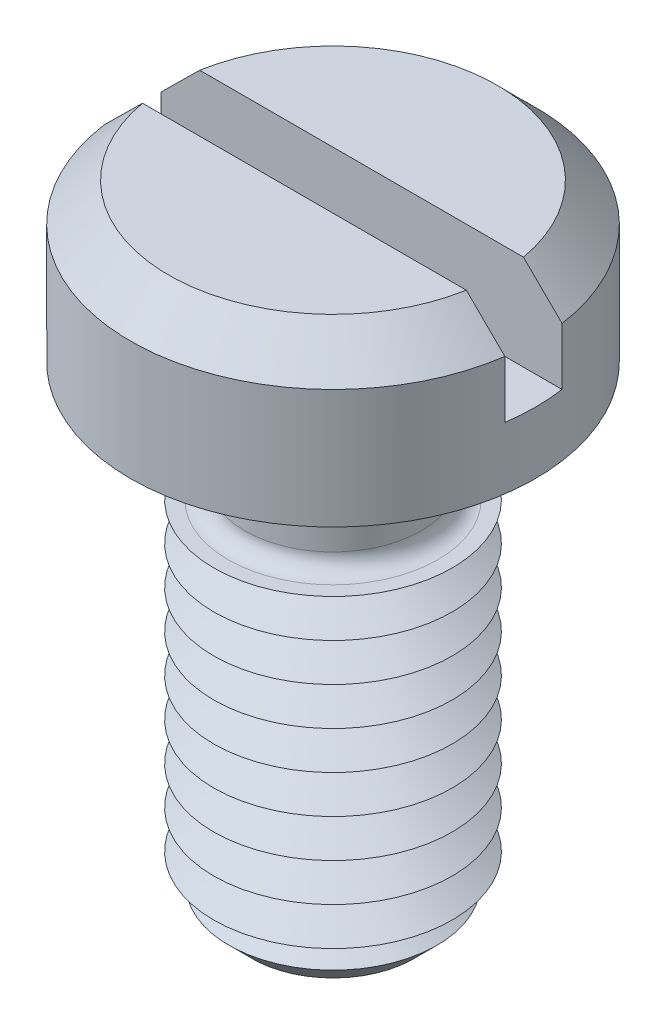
ISO-10303-21;
HEADER;
FILE_DESCRIPTION(('STEP AP214'),'2;1');
FILE_NAME('part.step','',(''),(''),'','','');
FILE_SCHEMA(('AUTOMOTIVE_DESIGN { 1 0 10303 214 1 1 1 1 }'));
ENDSEC;
DATA;
#1=APPLICATION_CONTEXT('core data for automotive mechanical design processes');
#2=APPLICATION_PROTOCOL_DEFINITION('international standard','automotive_design',2000,#1);
#3=PRODUCT_CONTEXT('',#1,'mechanical');
#4=PRODUCT('Part','Part','',(#3));
#5=PRODUCT_RELATED_PRODUCT_CATEGORY('part','',(#4));
#6=PRODUCT_DEFINITION_FORMATION('','',#4);
#7=PRODUCT_DEFINITION_CONTEXT('part definition',#1,'design');
#8=PRODUCT_DEFINITION('design','',#6,#7);
#9=PRODUCT_DEFINITION_SHAPE('','',#8);
#10=(LENGTH_UNIT() NAMED_UNIT(*) SI_UNIT(.MILLI.,.METRE.));
#11=(NAMED_UNIT(*) PLANE_ANGLE_UNIT() SI_UNIT($,.RADIAN.));
#12=(NAMED_UNIT(*) SI_UNIT($,.STERADIAN.) SOLID_ANGLE_UNIT());
#13=UNCERTAINTY_MEASURE_WITH_UNIT(LENGTH_MEASURE(1.E-05),#10,'distance_accuracy_value','');
#14=(GEOMETRIC_REPRESENTATION_CONTEXT(3) GLOBAL_UNCERTAINTY_ASSIGNED_CONTEXT((#13)) GLOBAL_UNIT_ASSIGNED_CONTEXT((#10,
#11,#12)) REPRESENTATION_CONTEXT('',''));
#15=CARTESIAN_POINT('',(0.,0.,0.));
#16=DIRECTION('',(0.,0.,1.));
#17=DIRECTION('',(1.,0.,0.));
#18=AXIS2_PLACEMENT_3D('',#15,#16,#17);
#19=CARTESIAN_POINT('',(0.,3.3,0.));
#20=DIRECTION('',(0.,1.,0.));
#21=DIRECTION('',(0.,0.,1.));
#22=AXIS2_PLACEMENT_3D('',#19,#20,#21);
#23=PLANE('',#22);
#24=DIRECTION('',(-1.,0.,0.));
#25=VECTOR('',#24,1.);
#26=CARTESIAN_POINT('',(4.25,3.3,-0.6));
#27=LINE('',#26,#25);
#28=CARTESIAN_POINT('',(3.39742549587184,3.3,-0.6));
#29=VERTEX_POINT('',#28);
#30=CARTESIAN_POINT('',(-3.39742549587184,3.3,-0.6));
#31=VERTEX_POINT('',#30);
#32=EDGE_CURVE('E110',#29,#31,#27,.T.);
#33=ORIENTED_EDGE('',*,*,#32,.F.);
#34=CARTESIAN_POINT('',(0.,3.3,0.));
#35=DIRECTION('',(0.,1.,0.));
#36=DIRECTION('',(0.,0.,1.));
#37=AXIS2_PLACEMENT_3D('',#34,#35,#36);
#38=CIRCLE('',#37,3.45000000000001);
#39=EDGE_CURVE('E113',#29,#31,#38,.T.);
#40=ORIENTED_EDGE('',*,*,#39,.T.);
#41=EDGE_LOOP('',(#33,#40));
#42=FACE_BOUND('',#41,.T.);
#43=ADVANCED_FACE('F39',(#42),#23,.T.);
#44=CARTESIAN_POINT('',(0.,3.3,0.));
#45=DIRECTION('',(0.,-1.,0.));
#46=DIRECTION('',(0.,0.,-1.));
#47=AXIS2_PLACEMENT_3D('',#44,#45,#46);
#48=CONICAL_SURFACE('',#47,3.45000000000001,0.785398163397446);
#49=CARTESIAN_POINT('',(9.35351408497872,-2.62273843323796,-0.6));
#50=CARTESIAN_POINT('',(9.03263557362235,-2.3025231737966,-0.6));
#51=CARTESIAN_POINT('',(8.71172811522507,-1.9823369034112,-0.6));
#52=CARTESIAN_POINT('',(8.06981262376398,-1.34205341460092,-0.6));
#53=CARTESIAN_POINT('',(7.74880458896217,-1.02195619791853,-0.6));
#54=CARTESIAN_POINT('',(7.10652460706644,-0.38176164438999,-0.6));
#55=CARTESIAN_POINT('',(6.78525260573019,-0.0616643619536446,-0.6));
#56=CARTESIAN_POINT('',(6.14251393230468,0.578323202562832,-0.6));
#57=CARTESIAN_POINT('',(5.82104726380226,0.898213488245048,-0.6));
#58=CARTESIAN_POINT('',(5.17196209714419,1.5434750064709,-0.6));
#59=CARTESIAN_POINT('',(4.84433778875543,1.86884039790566,-0.6));
#60=CARTESIAN_POINT('',(4.35244442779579,2.35644593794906,-0.6));
#61=CARTESIAN_POINT('',(4.18839924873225,2.51891187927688,-0.6));
#62=CARTESIAN_POINT('',(3.86009606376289,2.84362679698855,-0.6));
#63=CARTESIAN_POINT('',(3.69583805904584,3.0058757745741,-0.6));
#64=CARTESIAN_POINT('',(3.36705354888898,3.33001661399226,-0.6));
#65=CARTESIAN_POINT('',(3.20252712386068,3.49190855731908,-0.6));
#66=CARTESIAN_POINT('',(2.87298689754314,3.81520272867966,-0.6));
#67=CARTESIAN_POINT('',(2.70797308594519,3.97660494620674,-0.6));
#68=CARTESIAN_POINT('',(2.37716903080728,4.29858210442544,-0.6));
#69=CARTESIAN_POINT('',(2.21137886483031,4.45915712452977,-0.6));
#70=CARTESIAN_POINT('',(1.96157219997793,4.69884609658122,-0.6));
#71=CARTESIAN_POINT('',(1.87811785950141,4.77854546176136,-0.6));
#72=CARTESIAN_POINT('',(1.71066064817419,4.93736532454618,-0.6));
#73=CARTESIAN_POINT('',(1.62665778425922,5.01648582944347,-0.6));
#74=CARTESIAN_POINT('',(1.49655488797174,5.13773269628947,-0.6));
#75=CARTESIAN_POINT('',(1.45074972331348,5.18017521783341,-0.6));
#76=CARTESIAN_POINT('',(1.35882119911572,5.26471614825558,-0.6));
#77=CARTESIAN_POINT('',(1.31269783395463,5.30681455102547,-0.6));
#78=CARTESIAN_POINT('',(1.22008852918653,5.39050695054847,-0.6));
#79=CARTESIAN_POINT('',(1.17360305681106,5.43210146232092,-0.6));
#80=CARTESIAN_POINT('',(1.08007401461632,5.51465347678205,-0.6));
#81=CARTESIAN_POINT('',(1.03303046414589,5.55561100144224,-0.6));
#82=CARTESIAN_POINT('',(0.919047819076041,5.65299331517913,-0.6));
#83=CARTESIAN_POINT('',(0.851738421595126,5.70899242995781,-0.6));
#84=CARTESIAN_POINT('',(0.748806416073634,5.79068526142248,-0.6));
#85=CARTESIAN_POINT('',(0.714125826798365,5.81756213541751,-0.6));
#86=CARTESIAN_POINT('',(0.643915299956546,5.87018079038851,-0.6));
#87=CARTESIAN_POINT('',(0.608385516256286,5.89592277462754,-0.6));
#88=CARTESIAN_POINT('',(0.545162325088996,5.93955652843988,-0.6));
#89=CARTESIAN_POINT('',(0.517718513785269,5.95780799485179,-0.6));
#90=CARTESIAN_POINT('',(0.462025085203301,5.9930317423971,-0.6));
#91=CARTESIAN_POINT('',(0.433775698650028,6.01000438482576,-0.6));
#92=CARTESIAN_POINT('',(0.37634195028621,6.04213837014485,-0.6));
#93=CARTESIAN_POINT('',(0.347160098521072,6.05730412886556,-0.6));
#94=CARTESIAN_POINT('',(0.2876425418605,6.08513394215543,-0.6));
#95=CARTESIAN_POINT('',(0.25730803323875,6.09780051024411,-0.6));
#96=CARTESIAN_POINT('',(0.190863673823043,6.12124627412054,-0.6));
#97=CARTESIAN_POINT('',(0.154554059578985,6.13148571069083,-0.6));
#98=CARTESIAN_POINT('',(0.0807909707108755,6.14565404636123,-0.6));
#99=CARTESIAN_POINT('',(0.0433423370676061,6.14960664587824,-0.6));
#100=CARTESIAN_POINT('',(-0.0317987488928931,6.15033783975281,-0.6));
#101=CARTESIAN_POINT('',(-0.0694915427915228,6.14708428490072,-0.6));
#102=CARTESIAN_POINT('',(-0.143790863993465,6.13410921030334,-0.6));
#103=CARTESIAN_POINT('',(-0.180393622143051,6.12436747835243,-0.6));
#104=CARTESIAN_POINT('',(-0.254098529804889,6.09939647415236,-0.6));
#105=CARTESIAN_POINT('',(-0.291094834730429,6.08386859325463,-0.6));
#106=CARTESIAN_POINT('',(-0.363408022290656,6.04924663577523,-0.6));
#107=CARTESIAN_POINT('',(-0.398721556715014,6.03014579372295,-0.6));
#108=CARTESIAN_POINT('',(-0.46823452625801,5.98944452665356,-0.6));
#109=CARTESIAN_POINT('',(-0.502422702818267,5.96782521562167,-0.6));
#110=CARTESIAN_POINT('',(-0.569689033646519,5.9230061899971,-0.6));
#111=CARTESIAN_POINT('',(-0.602768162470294,5.89980792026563,-0.6));
#112=CARTESIAN_POINT('',(-0.671148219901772,5.85008963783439,-0.6));
#113=CARTESIAN_POINT('',(-0.706369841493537,5.82346130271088,-0.6));
#114=CARTESIAN_POINT('',(-0.77608772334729,5.76926828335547,-0.6));
#115=CARTESIAN_POINT('',(-0.810583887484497,5.74170347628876,-0.6));
#116=CARTESIAN_POINT('',(-0.913286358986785,5.65798278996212,-0.6));
#117=CARTESIAN_POINT('',(-0.980673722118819,5.60082541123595,-0.6));
#118=CARTESIAN_POINT('',(-1.11424616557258,5.48490670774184,-0.6));
#119=CARTESIAN_POINT('',(-1.18042891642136,5.42614273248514,-0.6));
#120=CARTESIAN_POINT('',(-1.31191262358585,5.30767463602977,-0.6));
#121=CARTESIAN_POINT('',(-1.37721382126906,5.24797078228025,-0.6));
#122=CARTESIAN_POINT('',(-1.5070108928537,5.12812906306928,-0.6));
#123=CARTESIAN_POINT('',(-1.57150872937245,5.06799331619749,-0.6));
#124=CARTESIAN_POINT('',(-1.70009132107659,4.94727328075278,-0.6));
#125=CARTESIAN_POINT('',(-1.76417604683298,4.88668896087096,-0.6));
#126=CARTESIAN_POINT('',(-1.95584105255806,4.7045882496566,-0.6));
#127=CARTESIAN_POINT('',(-2.08296922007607,4.58259645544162,-0.6));
#128=CARTESIAN_POINT('',(-2.33599178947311,4.33840625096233,-0.6));
#129=CARTESIAN_POINT('',(-2.46188913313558,4.21621087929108,-0.6));
#130=CARTESIAN_POINT('',(-2.7132351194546,3.97135925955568,-0.6));
#131=CARTESIAN_POINT('',(-2.83868376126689,3.84870301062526,-0.6));
#132=CARTESIAN_POINT('',(-3.21459106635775,3.48027743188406,-0.6));
#133=CARTESIAN_POINT('',(-3.46460626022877,3.2340559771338,-0.6));
#134=CARTESIAN_POINT('',(-3.96413793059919,2.74090313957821,-0.6));
#135=CARTESIAN_POINT('',(-4.21365415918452,2.4939715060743,-0.6));
#136=CARTESIAN_POINT('',(-4.7123247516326,1.99974737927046,-0.6));
#137=CARTESIAN_POINT('',(-4.96147911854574,1.75245488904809,-0.6));
#138=CARTESIAN_POINT('',(-5.45958725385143,1.25761544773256,-0.6));
#139=CARTESIAN_POINT('',(-5.70854099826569,1.01006847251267,-0.6));
#140=CARTESIAN_POINT('',(-6.2062949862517,0.514819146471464,-0.6));
#141=CARTESIAN_POINT('',(-6.45509522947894,0.267116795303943,-0.6));
#142=CARTESIAN_POINT('',(-7.20128563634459,-0.476100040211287,-0.6));
#143=CARTESIAN_POINT('',(-7.69851620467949,-0.971774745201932,-0.6));
#144=CARTESIAN_POINT('',(-8.38865115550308,-1.66007026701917,-0.6));
#145=CARTESIAN_POINT('',(-8.58165346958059,-1.8525929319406,-0.6));
#146=CARTESIAN_POINT('',(-8.87112736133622,-2.14139225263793,-0.6));
#147=CARTESIAN_POINT('',(-8.96761014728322,-2.23765767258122,-0.6));
#148=CARTESIAN_POINT('',(-9.16056764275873,-2.43019387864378,-0.6));
#149=CARTESIAN_POINT('',(-9.25704235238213,-2.52646466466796,-0.6));
#150=CARTESIAN_POINT('',(-9.35351408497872,-2.62273843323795,-0.6));
#151=B_SPLINE_CURVE_WITH_KNOTS('',3,(#49,#50,#51,#52,#53,#54,#55,#56,#57,#58,#59,#60,#61,#62,
#63,#64,#65,#66,#67,#68,#69,#70,#71,#72,#73,#74,#75,#76,#77,#78,#79,#80,#81,#82,#83,#84,#85,#86,
#87,#88,#89,#90,#91,#92,#93,#94,#95,#96,#97,#98,#99,#100,#101,#102,#103,#104,#105,#106,#107,
#108,#109,#110,#111,#112,#113,#114,#115,#116,#117,#118,#119,#120,#121,#122,#123,#124,#125,#126,
#127,#128,#129,#130,#131,#132,#133,#134,#135,#136,#137,#138,#139,#140,#141,#142,#143,#144,#145,
#146,#147,#148,#149,#150),.UNSPECIFIED.,.F.,.F.,(4,2,2,2,2,2,2,2,2,2,2,2,2,2,2,2,2,2,2,2,2,2,2,
2,2,2,2,2,2,2,2,2,2,2,2,2,2,2,2,2,2,2,2,2,2,2,2,2,2,2,4),(0.,1.35996600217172,2.71995696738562,
4.08050889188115,5.44103646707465,6.82624457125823,7.51888721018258,8.21152599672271,
8.90398568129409,9.59646011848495,10.288866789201,10.635058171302,10.9812451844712,
11.1685812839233,11.3559207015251,11.5430489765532,11.7301707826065,11.9927784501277,
12.1243921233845,12.2559821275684,12.3548333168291,12.4536564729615,12.5522329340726,
12.6507097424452,12.7634617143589,12.8757876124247,12.9886156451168,13.1017968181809,
13.2218851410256,13.3422031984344,13.4634899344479,13.584667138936,13.7171086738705,
13.8495676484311,14.1146090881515,14.3801178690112,14.6455524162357,14.910099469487,
15.17466516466,15.7032346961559,16.2295761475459,16.7559185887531,17.8086237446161,
18.8617626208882,19.9148925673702,20.9681337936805,22.0213773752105,24.1276499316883,
24.9454725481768,25.3543534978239,25.7632286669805),.UNSPECIFIED.);
#152=CARTESIAN_POINT('',(4.20743389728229,2.5,-0.6));
#153=VERTEX_POINT('',#152);
#154=EDGE_CURVE('E268',#153,#29,#151,.T.);
#155=ORIENTED_EDGE('',*,*,#154,.F.);
#156=CARTESIAN_POINT('',(0.,2.5,0.));
#157=DIRECTION('',(0.,1.,0.));
#158=DIRECTION('',(0.,0.,1.));
#159=AXIS2_PLACEMENT_3D('',#156,#157,#158);
#160=CIRCLE('',#159,4.25);
#161=CARTESIAN_POINT('',(-4.20743389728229,2.5,-0.6));
#162=VERTEX_POINT('',#161);
#163=EDGE_CURVE('E128',#162,#153,#160,.F.);
#164=ORIENTED_EDGE('',*,*,#163,.F.);
#165=EDGE_CURVE('E102',#31,#162,#151,.T.);
#166=ORIENTED_EDGE('',*,*,#165,.F.);
#167=ORIENTED_EDGE('',*,*,#39,.F.);
#168=EDGE_LOOP('',(#155,#164,#166,#167));
#169=FACE_BOUND('',#168,.T.);
#170=ADVANCED_FACE('F230',(#169),#48,.T.);
#171=CARTESIAN_POINT('',(0.,-10.,0.));
#172=DIRECTION('',(0.,1.,0.));
#173=DIRECTION('',(0.,0.,1.));
#174=AXIS2_PLACEMENT_3D('',#171,#172,#173);
#175=CYLINDRICAL_SURFACE('',#174,1.85);
#176=CARTESIAN_POINT('',(0.,-2.15,0.));
#177=DIRECTION('',(0.,-1.,0.));
#178=DIRECTION('',(0.,0.,-1.));
#179=AXIS2_PLACEMENT_3D('',#176,#177,#178);
#180=CIRCLE('',#179,1.85);
#181=CARTESIAN_POINT('',(0.,-2.15,-1.85));
#182=VERTEX_POINT('',#181);
#183=EDGE_CURVE('E123',#182,#182,#180,.F.);
#184=ORIENTED_EDGE('',*,*,#183,.T.);
#185=EDGE_LOOP('',(#184));
#186=FACE_BOUND('',#185,.T.);
#187=CARTESIAN_POINT('',(0.,-0.35,0.));
#188=DIRECTION('',(0.,1.,0.));
#189=DIRECTION('',(0.,0.,1.));
#190=AXIS2_PLACEMENT_3D('',#187,#188,#189);
#191=CIRCLE('',#190,1.85);
#192=CARTESIAN_POINT('',(0.,-0.35,1.85));
#193=VERTEX_POINT('',#192);
#194=EDGE_CURVE('E381',#193,#193,#191,.F.);
#195=ORIENTED_EDGE('',*,*,#194,.T.);
#196=EDGE_LOOP('',(#195));
#197=FACE_BOUND('',#196,.T.);
#198=ADVANCED_FACE('F226',(#186,#197),#175,.T.);
#199=CARTESIAN_POINT('',(0.,3.3,0.));
#200=DIRECTION('',(0.,-1.,0.));
#201=DIRECTION('',(0.,0.,-1.));
#202=AXIS2_PLACEMENT_3D('',#199,#200,#201);
#203=CYLINDRICAL_SURFACE('',#202,4.25);
#204=ORIENTED_EDGE('',*,*,#163,.T.);
#205=DIRECTION('',(0.,-1.,0.));
#206=VECTOR('',#205,1.);
#207=CARTESIAN_POINT('',(4.20743389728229,3.3,-0.6));
#208=LINE('',#207,#206);
#209=CARTESIAN_POINT('',(4.20743389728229,1.3,-0.6));
#210=VERTEX_POINT('',#209);
#211=EDGE_CURVE('E64',#153,#210,#208,.T.);
#212=ORIENTED_EDGE('',*,*,#211,.T.);
#213=CARTESIAN_POINT('',(0.,1.3,0.));
#214=DIRECTION('',(0.,1.,0.));
#215=DIRECTION('',(0.,0.,1.));
#216=AXIS2_PLACEMENT_3D('',#213,#214,#215);
#217=CIRCLE('',#216,4.25);
#218=CARTESIAN_POINT('',(4.20743389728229,1.3,0.6));
#219=VERTEX_POINT('',#218);
#220=EDGE_CURVE('E11',#219,#210,#217,.T.);
#221=ORIENTED_EDGE('',*,*,#220,.F.);
#222=DIRECTION('',(0.,-1.,0.));
#223=VECTOR('',#222,1.);
#224=CARTESIAN_POINT('',(4.20743389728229,3.3,0.6));
#225=LINE('',#224,#223);
#226=CARTESIAN_POINT('',(4.20743389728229,2.5,0.6));
#227=VERTEX_POINT('',#226);
#228=EDGE_CURVE('E284',#219,#227,#225,.F.);
#229=ORIENTED_EDGE('',*,*,#228,.T.);
#230=CARTESIAN_POINT('',(-4.20743389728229,2.5,0.6));
#231=VERTEX_POINT('',#230);
#232=EDGE_CURVE('E120',#227,#231,#160,.F.);
#233=ORIENTED_EDGE('',*,*,#232,.T.);
#234=DIRECTION('',(0.,-1.,0.));
#235=VECTOR('',#234,1.);
#236=CARTESIAN_POINT('',(-4.20743389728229,3.3,0.6));
#237=LINE('',#236,#235);
#238=CARTESIAN_POINT('',(-4.20743389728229,1.3,0.6));
#239=VERTEX_POINT('',#238);
#240=EDGE_CURVE('E96',#231,#239,#237,.T.);
#241=ORIENTED_EDGE('',*,*,#240,.T.);
#242=CARTESIAN_POINT('',(-4.20743389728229,1.3,-0.6));
#243=VERTEX_POINT('',#242);
#244=EDGE_CURVE('E44',#243,#239,#217,.T.);
#245=ORIENTED_EDGE('',*,*,#244,.F.);
#246=DIRECTION('',(0.,-1.,0.));
#247=VECTOR('',#246,1.);
#248=CARTESIAN_POINT('',(-4.20743389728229,3.3,-0.6));
#249=LINE('',#248,#247);
#250=EDGE_CURVE('E289',#243,#162,#249,.F.);
#251=ORIENTED_EDGE('',*,*,#250,.T.);
#252=EDGE_LOOP('',(#204,#212,#221,#229,#233,#241,#245,#251));
#253=FACE_BOUND('',#252,.T.);
#254=CARTESIAN_POINT('',(0.,0.,0.));
#255=DIRECTION('',(0.,1.,0.));
#256=DIRECTION('',(0.,0.,1.));
#257=AXIS2_PLACEMENT_3D('',#254,#255,#256);
#258=CIRCLE('',#257,4.25);
#259=CARTESIAN_POINT('',(0.,0.,4.25));
#260=VERTEX_POINT('',#259);
#261=EDGE_CURVE('E368',#260,#260,#258,.T.);
#262=ORIENTED_EDGE('',*,*,#261,.T.);
#263=EDGE_LOOP('',(#262));
#264=FACE_BOUND('',#263,.T.);
#265=ADVANCED_FACE('F229',(#253,#264),#203,.T.);
#266=DIRECTION('',(1.,0.,0.));
#267=VECTOR('',#266,1.);
#268=CARTESIAN_POINT('',(4.25,3.3,0.6));
#269=LINE('',#268,#267);
#270=CARTESIAN_POINT('',(-3.39742549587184,3.3,0.6));
#271=VERTEX_POINT('',#270);
#272=CARTESIAN_POINT('',(3.39742549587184,3.3,0.6));
#273=VERTEX_POINT('',#272);
#274=EDGE_CURVE('E56',#271,#273,#269,.T.);
#275=ORIENTED_EDGE('',*,*,#274,.F.);
#276=EDGE_CURVE('E108',#271,#273,#38,.T.);
#277=ORIENTED_EDGE('',*,*,#276,.T.);
#278=EDGE_LOOP('',(#275,#277));
#279=FACE_BOUND('',#278,.T.);
#280=ADVANCED_FACE('F107',(#279),#23,.T.);
#281=CARTESIAN_POINT('',(0.,0.,0.));
#282=DIRECTION('',(0.,1.,0.));
#283=DIRECTION('',(0.,0.,1.));
#284=AXIS2_PLACEMENT_3D('',#281,#282,#283);
#285=PLANE('',#284);
#286=CARTESIAN_POINT('',(0.,0.,0.));
#287=DIRECTION('',(0.,1.,0.));
#288=DIRECTION('',(0.,0.,1.));
#289=AXIS2_PLACEMENT_3D('',#286,#287,#288);
#290=CIRCLE('',#289,2.2);
#291=CARTESIAN_POINT('',(0.,0.,2.2));
#292=VERTEX_POINT('',#291);
#293=EDGE_CURVE('E114',#292,#292,#290,.T.);
#294=ORIENTED_EDGE('',*,*,#293,.T.);
#295=EDGE_LOOP('',(#294));
#296=FACE_BOUND('',#295,.T.);
#297=ORIENTED_EDGE('',*,*,#261,.F.);
#298=EDGE_LOOP('',(#297));
#299=FACE_BOUND('',#298,.T.);
#300=ADVANCED_FACE('F220',(#296,#299),#285,.F.);
#301=CARTESIAN_POINT('',(0.,-2.5,0.));
#302=DIRECTION('',(0.,-1.,0.));
#303=DIRECTION('',(0.,0.,-1.));
#304=AXIS2_PLACEMENT_3D('',#301,#302,#303);
#305=PLANE('',#304);
#306=CARTESIAN_POINT('',(0.,-2.5,0.));
#307=DIRECTION('',(0.,-1.,0.));
#308=DIRECTION('',(0.,0.,-1.));
#309=AXIS2_PLACEMENT_3D('',#306,#307,#308);
#310=CIRCLE('',#309,2.2);
#311=CARTESIAN_POINT('',(0.,-2.5,-2.2));
#312=VERTEX_POINT('',#311);
#313=EDGE_CURVE('E376',#312,#312,#310,.T.);
#314=ORIENTED_EDGE('',*,*,#313,.T.);
#315=EDGE_LOOP('',(#314));
#316=FACE_BOUND('',#315,.T.);
#317=CARTESIAN_POINT('',(0.,-2.5,0.));
#318=DIRECTION('',(0.,1.,0.));
#319=DIRECTION('',(0.,0.,1.));
#320=AXIS2_PLACEMENT_3D('',#317,#318,#319);
#321=CIRCLE('',#320,2.5);
#322=CARTESIAN_POINT('',(0.,-2.5,2.5));
#323=VERTEX_POINT('',#322);
#324=EDGE_CURVE('E364',#323,#323,#321,.T.);
#325=ORIENTED_EDGE('',*,*,#324,.T.);
#326=EDGE_LOOP('',(#325));
#327=FACE_BOUND('',#326,.T.);
#328=ADVANCED_FACE('F216',(#316,#327),#305,.F.);
#329=CARTESIAN_POINT('',(0.,-2.9,0.));
#330=DIRECTION('',(0.,1.,0.));
#331=DIRECTION('',(0.,0.,1.));
#332=AXIS2_PLACEMENT_3D('',#329,#330,#331);
#333=CONICAL_SURFACE('',#332,1.80717967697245,1.0471975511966);
#334=ORIENTED_EDGE('',*,*,#324,.F.);
#335=EDGE_LOOP('',(#334));
#336=FACE_BOUND('',#335,.T.);
#337=CARTESIAN_POINT('',(0.,-2.9,0.));
#338=DIRECTION('',(0.,1.,0.));
#339=DIRECTION('',(0.,0.,1.));
#340=AXIS2_PLACEMENT_3D('',#337,#338,#339);
#341=CIRCLE('',#340,1.80717967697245);
#342=CARTESIAN_POINT('',(0.,-2.9,1.80717967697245));
#343=VERTEX_POINT('',#342);
#344=EDGE_CURVE('E360',#343,#343,#341,.T.);
#345=ORIENTED_EDGE('',*,*,#344,.T.);
#346=EDGE_LOOP('',(#345));
#347=FACE_BOUND('',#346,.T.);
#348=ADVANCED_FACE('F212',(#336,#347),#333,.T.);
#349=CARTESIAN_POINT('',(0.,-3.3,0.));
#350=DIRECTION('',(0.,-1.,0.));
#351=DIRECTION('',(0.,0.,-1.));
#352=AXIS2_PLACEMENT_3D('',#349,#350,#351);
#353=CONICAL_SURFACE('',#352,2.5,1.04719755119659);
#354=ORIENTED_EDGE('',*,*,#344,.F.);
#355=EDGE_LOOP('',(#354));
#356=FACE_BOUND('',#355,.T.);
#357=CARTESIAN_POINT('',(0.,-3.3,0.));
#358=DIRECTION('',(0.,1.,0.));
#359=DIRECTION('',(0.,0.,1.));
#360=AXIS2_PLACEMENT_3D('',#357,#358,#359);
#361=CIRCLE('',#360,2.5);
#362=CARTESIAN_POINT('',(0.,-3.3,2.5));
#363=VERTEX_POINT('',#362);
#364=EDGE_CURVE('E356',#363,#363,#361,.T.);
#365=ORIENTED_EDGE('',*,*,#364,.T.);
#366=EDGE_LOOP('',(#365));
#367=FACE_BOUND('',#366,.T.);
#368=ADVANCED_FACE('F208',(#356,#367),#353,.T.);
#369=CARTESIAN_POINT('',(0.,-3.7,0.));
#370=DIRECTION('',(0.,1.,0.));
#371=DIRECTION('',(0.,0.,1.));
#372=AXIS2_PLACEMENT_3D('',#369,#370,#371);
#373=CONICAL_SURFACE('',#372,1.80717967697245,1.0471975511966);
#374=ORIENTED_EDGE('',*,*,#364,.F.);
#375=EDGE_LOOP('',(#374));
#376=FACE_BOUND('',#375,.T.);
#377=CARTESIAN_POINT('',(0.,-3.7,0.));
#378=DIRECTION('',(0.,1.,0.));
#379=DIRECTION('',(0.,0.,1.));
#380=AXIS2_PLACEMENT_3D('',#377,#378,#379);
#381=CIRCLE('',#380,1.80717967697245);
#382=CARTESIAN_POINT('',(0.,-3.7,1.80717967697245));
#383=VERTEX_POINT('',#382);
#384=EDGE_CURVE('E353',#383,#383,#381,.T.);
#385=ORIENTED_EDGE('',*,*,#384,.T.);
#386=EDGE_LOOP('',(#385));
#387=FACE_BOUND('',#386,.T.);
#388=ADVANCED_FACE('F204',(#376,#387),#373,.T.);
#389=CARTESIAN_POINT('',(0.,-4.1,0.));
#390=DIRECTION('',(0.,-1.,0.));
#391=DIRECTION('',(0.,0.,-1.));
#392=AXIS2_PLACEMENT_3D('',#389,#390,#391);
#393=CONICAL_SURFACE('',#392,2.5,1.04719755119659);
#394=ORIENTED_EDGE('',*,*,#384,.F.);
#395=EDGE_LOOP('',(#394));
#396=FACE_BOUND('',#395,.T.);
#397=CARTESIAN_POINT('',(0.,-4.1,0.));
#398=DIRECTION('',(0.,1.,0.));
#399=DIRECTION('',(0.,0.,1.));
#400=AXIS2_PLACEMENT_3D('',#397,#398,#399);
#401=CIRCLE('',#400,2.5);
#402=CARTESIAN_POINT('',(0.,-4.1,2.5));
#403=VERTEX_POINT('',#402);
#404=EDGE_CURVE('E349',#403,#403,#401,.T.);
#405=ORIENTED_EDGE('',*,*,#404,.T.);
#406=EDGE_LOOP('',(#405));
#407=FACE_BOUND('',#406,.T.);
#408=ADVANCED_FACE('F200',(#396,#407),#393,.T.);
#409=CARTESIAN_POINT('',(0.,-4.5,0.));
#410=DIRECTION('',(0.,1.,0.));
#411=DIRECTION('',(0.,0.,1.));
#412=AXIS2_PLACEMENT_3D('',#409,#410,#411);
#413=CONICAL_SURFACE('',#412,1.80717967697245,1.0471975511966);
#414=ORIENTED_EDGE('',*,*,#404,.F.);
#415=EDGE_LOOP('',(#414));
#416=FACE_BOUND('',#415,.T.);
#417=CARTESIAN_POINT('',(0.,-4.5,0.));
#418=DIRECTION('',(0.,1.,0.));
#419=DIRECTION('',(0.,0.,1.));
#420=AXIS2_PLACEMENT_3D('',#417,#418,#419);
#421=CIRCLE('',#420,1.80717967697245);
#422=CARTESIAN_POINT('',(0.,-4.5,1.80717967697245));
#423=VERTEX_POINT('',#422);
#424=EDGE_CURVE('E345',#423,#423,#421,.T.);
#425=ORIENTED_EDGE('',*,*,#424,.T.);
#426=EDGE_LOOP('',(#425));
#427=FACE_BOUND('',#426,.T.);
#428=ADVANCED_FACE('F196',(#416,#427),#413,.T.);
#429=CARTESIAN_POINT('',(0.,-4.9,0.));
#430=DIRECTION('',(0.,-1.,0.));
#431=DIRECTION('',(0.,0.,-1.));
#432=AXIS2_PLACEMENT_3D('',#429,#430,#431);
#433=CONICAL_SURFACE('',#432,2.5,1.04719755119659);
#434=ORIENTED_EDGE('',*,*,#424,.F.);
#435=EDGE_LOOP('',(#434));
#436=FACE_BOUND('',#435,.T.);
#437=CARTESIAN_POINT('',(0.,-4.9,0.));
#438=DIRECTION('',(0.,1.,0.));
#439=DIRECTION('',(0.,0.,1.));
#440=AXIS2_PLACEMENT_3D('',#437,#438,#439);
#441=CIRCLE('',#440,2.5);
#442=CARTESIAN_POINT('',(0.,-4.9,2.5));
#443=VERTEX_POINT('',#442);
#444=EDGE_CURVE('E341',#443,#443,#441,.T.);
#445=ORIENTED_EDGE('',*,*,#444,.T.);
#446=EDGE_LOOP('',(#445));
#447=FACE_BOUND('',#446,.T.);
#448=ADVANCED_FACE('F192',(#436,#447),#433,.T.);
#449=CARTESIAN_POINT('',(0.,-5.3,0.));
#450=DIRECTION('',(0.,1.,0.));
#451=DIRECTION('',(0.,0.,1.));
#452=AXIS2_PLACEMENT_3D('',#449,#450,#451);
#453=CONICAL_SURFACE('',#452,1.80717967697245,1.0471975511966);
#454=ORIENTED_EDGE('',*,*,#444,.F.);
#455=EDGE_LOOP('',(#454));
#456=FACE_BOUND('',#455,.T.);
#457=CARTESIAN_POINT('',(0.,-5.3,0.));
#458=DIRECTION('',(0.,1.,0.));
#459=DIRECTION('',(0.,0.,1.));
#460=AXIS2_PLACEMENT_3D('',#457,#458,#459);
#461=CIRCLE('',#460,1.80717967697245);
#462=CARTESIAN_POINT('',(0.,-5.3,1.80717967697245));
#463=VERTEX_POINT('',#462);
#464=EDGE_CURVE('E338',#463,#463,#461,.T.);
#465=ORIENTED_EDGE('',*,*,#464,.T.);
#466=EDGE_LOOP('',(#465));
#467=FACE_BOUND('',#466,.T.);
#468=ADVANCED_FACE('F188',(#456,#467),#453,.T.);
#469=CARTESIAN_POINT('',(0.,-5.7,0.));
#470=DIRECTION('',(0.,-1.,0.));
#471=DIRECTION('',(0.,0.,-1.));
#472=AXIS2_PLACEMENT_3D('',#469,#470,#471);
#473=CONICAL_SURFACE('',#472,2.5,1.04719755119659);
#474=ORIENTED_EDGE('',*,*,#464,.F.);
#475=EDGE_LOOP('',(#474));
#476=FACE_BOUND('',#475,.T.);
#477=CARTESIAN_POINT('',(0.,-5.7,0.));
#478=DIRECTION('',(0.,1.,0.));
#479=DIRECTION('',(0.,0.,1.));
#480=AXIS2_PLACEMENT_3D('',#477,#478,#479);
#481=CIRCLE('',#480,2.5);
#482=CARTESIAN_POINT('',(0.,-5.7,2.5));
#483=VERTEX_POINT('',#482);
#484=EDGE_CURVE('E334',#483,#483,#481,.T.);
#485=ORIENTED_EDGE('',*,*,#484,.T.);
#486=EDGE_LOOP('',(#485));
#487=FACE_BOUND('',#486,.T.);
#488=ADVANCED_FACE('F184',(#476,#487),#473,.T.);
#489=CARTESIAN_POINT('',(0.,-6.1,0.));
#490=DIRECTION('',(0.,1.,0.));
#491=DIRECTION('',(0.,0.,1.));
#492=AXIS2_PLACEMENT_3D('',#489,#490,#491);
#493=CONICAL_SURFACE('',#492,1.80717967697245,1.0471975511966);
#494=ORIENTED_EDGE('',*,*,#484,.F.);
#495=EDGE_LOOP('',(#494));
#496=FACE_BOUND('',#495,.T.);
#497=CARTESIAN_POINT('',(0.,-6.1,0.));
#498=DIRECTION('',(0.,1.,0.));
#499=DIRECTION('',(0.,0.,1.));
#500=AXIS2_PLACEMENT_3D('',#497,#498,#499);
#501=CIRCLE('',#500,1.80717967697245);
#502=CARTESIAN_POINT('',(0.,-6.1,1.80717967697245));
#503=VERTEX_POINT('',#502);
#504=EDGE_CURVE('E330',#503,#503,#501,.T.);
#505=ORIENTED_EDGE('',*,*,#504,.T.);
#506=EDGE_LOOP('',(#505));
#507=FACE_BOUND('',#506,.T.);
#508=ADVANCED_FACE('F180',(#496,#507),#493,.T.);
#509=CARTESIAN_POINT('',(0.,-6.5,0.));
#510=DIRECTION('',(0.,-1.,0.));
#511=DIRECTION('',(0.,0.,-1.));
#512=AXIS2_PLACEMENT_3D('',#509,#510,#511);
#513=CONICAL_SURFACE('',#512,2.5,1.04719755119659);
#514=ORIENTED_EDGE('',*,*,#504,.F.);
#515=EDGE_LOOP('',(#514));
#516=FACE_BOUND('',#515,.T.);
#517=CARTESIAN_POINT('',(0.,-6.5,0.));
#518=DIRECTION('',(0.,1.,0.));
#519=DIRECTION('',(0.,0.,1.));
#520=AXIS2_PLACEMENT_3D('',#517,#518,#519);
#521=CIRCLE('',#520,2.5);
#522=CARTESIAN_POINT('',(0.,-6.5,2.5));
#523=VERTEX_POINT('',#522);
#524=EDGE_CURVE('E326',#523,#523,#521,.T.);
#525=ORIENTED_EDGE('',*,*,#524,.T.);
#526=EDGE_LOOP('',(#525));
#527=FACE_BOUND('',#526,.T.);
#528=ADVANCED_FACE('F176',(#516,#527),#513,.T.);
#529=CARTESIAN_POINT('',(0.,-6.9,0.));
#530=DIRECTION('',(0.,1.,0.));
#531=DIRECTION('',(0.,0.,1.));
#532=AXIS2_PLACEMENT_3D('',#529,#530,#531);
#533=CONICAL_SURFACE('',#532,1.80717967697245,1.0471975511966);
#534=ORIENTED_EDGE('',*,*,#524,.F.);
#535=EDGE_LOOP('',(#534));
#536=FACE_BOUND('',#535,.T.);
#537=CARTESIAN_POINT('',(0.,-6.9,0.));
#538=DIRECTION('',(0.,1.,0.));
#539=DIRECTION('',(0.,0.,1.));
#540=AXIS2_PLACEMENT_3D('',#537,#538,#539);
#541=CIRCLE('',#540,1.80717967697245);
#542=CARTESIAN_POINT('',(0.,-6.9,1.80717967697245));
#543=VERTEX_POINT('',#542);
#544=EDGE_CURVE('E322',#543,#543,#541,.T.);
#545=ORIENTED_EDGE('',*,*,#544,.T.);
#546=EDGE_LOOP('',(#545));
#547=FACE_BOUND('',#546,.T.);
#548=ADVANCED_FACE('F172',(#536,#547),#533,.T.);
#549=CARTESIAN_POINT('',(0.,-7.3,0.));
#550=DIRECTION('',(0.,-1.,0.));
#551=DIRECTION('',(0.,0.,-1.));
#552=AXIS2_PLACEMENT_3D('',#549,#550,#551);
#553=CONICAL_SURFACE('',#552,2.5,1.04719755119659);
#554=ORIENTED_EDGE('',*,*,#544,.F.);
#555=EDGE_LOOP('',(#554));
#556=FACE_BOUND('',#555,.T.);
#557=CARTESIAN_POINT('',(0.,-7.3,0.));
#558=DIRECTION('',(0.,1.,0.));
#559=DIRECTION('',(0.,0.,1.));
#560=AXIS2_PLACEMENT_3D('',#557,#558,#559);
#561=CIRCLE('',#560,2.5);
#562=CARTESIAN_POINT('',(0.,-7.3,2.5));
#563=VERTEX_POINT('',#562);
#564=EDGE_CURVE('E318',#563,#563,#561,.T.);
#565=ORIENTED_EDGE('',*,*,#564,.T.);
#566=EDGE_LOOP('',(#565));
#567=FACE_BOUND('',#566,.T.);
#568=ADVANCED_FACE('F168',(#556,#567),#553,.T.);
#569=CARTESIAN_POINT('',(0.,-7.7,0.));
#570=DIRECTION('',(0.,1.,0.));
#571=DIRECTION('',(0.,0.,1.));
#572=AXIS2_PLACEMENT_3D('',#569,#570,#571);
#573=CONICAL_SURFACE('',#572,1.80717967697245,1.0471975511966);
#574=ORIENTED_EDGE('',*,*,#564,.F.);
#575=EDGE_LOOP('',(#574));
#576=FACE_BOUND('',#575,.T.);
#577=CARTESIAN_POINT('',(0.,-7.7,0.));
#578=DIRECTION('',(0.,1.,0.));
#579=DIRECTION('',(0.,0.,1.));
#580=AXIS2_PLACEMENT_3D('',#577,#578,#579);
#581=CIRCLE('',#580,1.80717967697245);
#582=CARTESIAN_POINT('',(0.,-7.7,1.80717967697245));
#583=VERTEX_POINT('',#582);
#584=EDGE_CURVE('E314',#583,#583,#581,.T.);
#585=ORIENTED_EDGE('',*,*,#584,.T.);
#586=EDGE_LOOP('',(#585));
#587=FACE_BOUND('',#586,.T.);
#588=ADVANCED_FACE('F164',(#576,#587),#573,.T.);
#589=CARTESIAN_POINT('',(0.,-8.1,0.));
#590=DIRECTION('',(0.,-1.,0.));
#591=DIRECTION('',(0.,0.,-1.));
#592=AXIS2_PLACEMENT_3D('',#589,#590,#591);
#593=CONICAL_SURFACE('',#592,2.5,1.04719755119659);
#594=ORIENTED_EDGE('',*,*,#584,.F.);
#595=EDGE_LOOP('',(#594));
#596=FACE_BOUND('',#595,.T.);
#597=CARTESIAN_POINT('',(0.,-8.1,0.));
#598=DIRECTION('',(0.,1.,0.));
#599=DIRECTION('',(0.,0.,1.));
#600=AXIS2_PLACEMENT_3D('',#597,#598,#599);
#601=CIRCLE('',#600,2.5);
#602=CARTESIAN_POINT('',(0.,-8.1,2.5));
#603=VERTEX_POINT('',#602);
#604=EDGE_CURVE('E311',#603,#603,#601,.T.);
#605=ORIENTED_EDGE('',*,*,#604,.T.);
#606=EDGE_LOOP('',(#605));
#607=FACE_BOUND('',#606,.T.);
#608=ADVANCED_FACE('F160',(#596,#607),#593,.T.);
#609=CARTESIAN_POINT('',(0.,-8.5,0.));
#610=DIRECTION('',(0.,1.,0.));
#611=DIRECTION('',(0.,0.,1.));
#612=AXIS2_PLACEMENT_3D('',#609,#610,#611);
#613=CONICAL_SURFACE('',#612,1.80717967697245,1.0471975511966);
#614=ORIENTED_EDGE('',*,*,#604,.F.);
#615=EDGE_LOOP('',(#614));
#616=FACE_BOUND('',#615,.T.);
#617=CARTESIAN_POINT('',(0.,-8.5,0.));
#618=DIRECTION('',(0.,1.,0.));
#619=DIRECTION('',(0.,0.,1.));
#620=AXIS2_PLACEMENT_3D('',#617,#618,#619);
#621=CIRCLE('',#620,1.80717967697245);
#622=CARTESIAN_POINT('',(0.,-8.5,1.80717967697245));
#623=VERTEX_POINT('',#622);
#624=EDGE_CURVE('E308',#623,#623,#621,.T.);
#625=ORIENTED_EDGE('',*,*,#624,.T.);
#626=EDGE_LOOP('',(#625));
#627=FACE_BOUND('',#626,.T.);
#628=ADVANCED_FACE('F156',(#616,#627),#613,.T.);
#629=CARTESIAN_POINT('',(0.,-8.90000000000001,0.));
#630=DIRECTION('',(0.,-1.,0.));
#631=DIRECTION('',(0.,0.,-1.));
#632=AXIS2_PLACEMENT_3D('',#629,#630,#631);
#633=CONICAL_SURFACE('',#632,2.5,1.04719755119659);
#634=ORIENTED_EDGE('',*,*,#624,.F.);
#635=EDGE_LOOP('',(#634));
#636=FACE_BOUND('',#635,.T.);
#637=CARTESIAN_POINT('',(0.,-8.9,0.));
#638=DIRECTION('',(0.,1.,0.));
#639=DIRECTION('',(0.,0.,1.));
#640=AXIS2_PLACEMENT_3D('',#637,#638,#639);
#641=CIRCLE('',#640,2.5);
#642=CARTESIAN_POINT('',(0.,-8.9,2.5));
#643=VERTEX_POINT('',#642);
#644=EDGE_CURVE('E303',#643,#643,#641,.T.);
#645=ORIENTED_EDGE('',*,*,#644,.T.);
#646=EDGE_LOOP('',(#645));
#647=FACE_BOUND('',#646,.T.);
#648=ADVANCED_FACE('F152',(#636,#647),#633,.T.);
#649=CARTESIAN_POINT('',(0.,-9.3,0.));
#650=DIRECTION('',(0.,1.,0.));
#651=DIRECTION('',(0.,0.,1.));
#652=AXIS2_PLACEMENT_3D('',#649,#650,#651);
#653=CONICAL_SURFACE('',#652,1.80717967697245,1.0471975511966);
#654=ORIENTED_EDGE('',*,*,#644,.F.);
#655=EDGE_LOOP('',(#654));
#656=FACE_BOUND('',#655,.T.);
#657=CARTESIAN_POINT('',(0.,-9.3,0.));
#658=DIRECTION('',(0.,1.,0.));
#659=DIRECTION('',(0.,0.,1.));
#660=AXIS2_PLACEMENT_3D('',#657,#658,#659);
#661=CIRCLE('',#660,1.80717967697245);
#662=CARTESIAN_POINT('',(0.,-9.3,1.80717967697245));
#663=VERTEX_POINT('',#662);
#664=EDGE_CURVE('E299',#663,#663,#661,.T.);
#665=ORIENTED_EDGE('',*,*,#664,.T.);
#666=EDGE_LOOP('',(#665));
#667=FACE_BOUND('',#666,.T.);
#668=ADVANCED_FACE('F148',(#656,#667),#653,.T.);
#669=CARTESIAN_POINT('',(0.,-9.7,0.));
#670=DIRECTION('',(0.,-1.,0.));
#671=DIRECTION('',(0.,0.,-1.));
#672=AXIS2_PLACEMENT_3D('',#669,#670,#671);
#673=CONICAL_SURFACE('',#672,2.5,1.04719755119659);
#674=CARTESIAN_POINT('',(0.,-9.51698729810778,0.));
#675=DIRECTION('',(0.,-1.,0.));
#676=DIRECTION('',(0.,0.,-1.));
#677=AXIS2_PLACEMENT_3D('',#674,#675,#676);
#678=CIRCLE('',#677,2.18301270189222);
#679=CARTESIAN_POINT('',(0.,-9.51698729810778,-2.18301270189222));
#680=VERTEX_POINT('',#679);
#681=EDGE_CURVE('E307',#680,#680,#678,.F.);
#682=ORIENTED_EDGE('',*,*,#681,.T.);
#683=EDGE_LOOP('',(#682));
#684=FACE_BOUND('',#683,.T.);
#685=ORIENTED_EDGE('',*,*,#664,.F.);
#686=EDGE_LOOP('',(#685));
#687=FACE_BOUND('',#686,.T.);
#688=ADVANCED_FACE('F144',(#684,#687),#673,.T.);
#689=CARTESIAN_POINT('',(0.,-10.,0.));
#690=DIRECTION('',(0.,-1.,0.));
#691=DIRECTION('',(0.,0.,-1.));
#692=AXIS2_PLACEMENT_3D('',#689,#690,#691);
#693=PLANE('',#692);
#694=CARTESIAN_POINT('',(0.,-10.,0.));
#695=DIRECTION('',(0.,-1.,0.));
#696=DIRECTION('',(0.,0.,-1.));
#697=AXIS2_PLACEMENT_3D('',#694,#695,#696);
#698=CIRCLE('',#697,1.7);
#699=CARTESIAN_POINT('',(0.,-10.,-1.7));
#700=VERTEX_POINT('',#699);
#701=EDGE_CURVE('E372',#700,#700,#698,.T.);
#702=ORIENTED_EDGE('',*,*,#701,.T.);
#703=EDGE_LOOP('',(#702));
#704=FACE_BOUND('',#703,.T.);
#705=ADVANCED_FACE('F147',(#704),#693,.T.);
#706=CARTESIAN_POINT('',(0.,-10.,0.));
#707=DIRECTION('',(0.,1.,0.));
#708=DIRECTION('',(0.,0.,1.));
#709=AXIS2_PLACEMENT_3D('',#706,#707,#708);
#710=CONICAL_SURFACE('',#709,1.7,0.785398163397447);
#711=ORIENTED_EDGE('',*,*,#681,.F.);
#712=EDGE_LOOP('',(#711));
#713=FACE_BOUND('',#712,.T.);
#714=ORIENTED_EDGE('',*,*,#701,.F.);
#715=EDGE_LOOP('',(#714));
#716=FACE_BOUND('',#715,.T.);
#717=ADVANCED_FACE('F224',(#713,#716),#710,.T.);
#718=CARTESIAN_POINT('',(0.,-2.15,0.));
#719=DIRECTION('',(0.,-1.,0.));
#720=DIRECTION('',(0.,0.,-1.));
#721=AXIS2_PLACEMENT_3D('',#718,#719,#720);
#722=TOROIDAL_SURFACE('',#721,2.2,0.35);
#723=ORIENTED_EDGE('',*,*,#183,.F.);
#724=EDGE_LOOP('',(#723));
#725=FACE_BOUND('',#724,.T.);
#726=ORIENTED_EDGE('',*,*,#313,.F.);
#727=EDGE_LOOP('',(#726));
#728=FACE_BOUND('',#727,.T.);
#729=ADVANCED_FACE('F242',(#725,#728),#722,.F.);
#730=CARTESIAN_POINT('',(0.,-0.35,0.));
#731=DIRECTION('',(0.,1.,0.));
#732=DIRECTION('',(0.,0.,1.));
#733=AXIS2_PLACEMENT_3D('',#730,#731,#732);
#734=TOROIDAL_SURFACE('',#733,2.2,0.35);
#735=ORIENTED_EDGE('',*,*,#293,.F.);
#736=EDGE_LOOP('',(#735));
#737=FACE_BOUND('',#736,.T.);
#738=ORIENTED_EDGE('',*,*,#194,.F.);
#739=EDGE_LOOP('',(#738));
#740=FACE_BOUND('',#739,.T.);
#741=ADVANCED_FACE('F245',(#737,#740),#734,.F.);
#742=CARTESIAN_POINT('',(-9.35351408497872,-2.62273843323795,0.6));
#743=CARTESIAN_POINT('',(-9.03263557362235,-2.3025231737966,0.6));
#744=CARTESIAN_POINT('',(-8.71172811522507,-1.9823369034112,0.6));
#745=CARTESIAN_POINT('',(-8.06981262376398,-1.34205341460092,0.6));
#746=CARTESIAN_POINT('',(-7.74880458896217,-1.02195619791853,0.6));
#747=CARTESIAN_POINT('',(-7.10652460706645,-0.381761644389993,0.6));
#748=CARTESIAN_POINT('',(-6.7852526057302,-0.0616643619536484,0.6));
#749=CARTESIAN_POINT('',(-6.14251393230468,0.578323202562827,0.6));
#750=CARTESIAN_POINT('',(-5.82104726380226,0.898213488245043,0.6));
#751=CARTESIAN_POINT('',(-5.1719620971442,1.5434750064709,0.6));
#752=CARTESIAN_POINT('',(-4.84433778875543,1.86884039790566,0.6));
#753=CARTESIAN_POINT('',(-4.35244442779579,2.35644593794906,0.6));
#754=CARTESIAN_POINT('',(-4.18839924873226,2.51891187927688,0.6));
#755=CARTESIAN_POINT('',(-3.86009606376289,2.84362679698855,0.6));
#756=CARTESIAN_POINT('',(-3.69583805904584,3.0058757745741,0.6));
#757=CARTESIAN_POINT('',(-3.36705354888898,3.33001661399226,0.6));
#758=CARTESIAN_POINT('',(-3.20252712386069,3.49190855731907,0.6));
#759=CARTESIAN_POINT('',(-2.87298689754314,3.81520272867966,0.6));
#760=CARTESIAN_POINT('',(-2.70797308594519,3.97660494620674,0.6));
#761=CARTESIAN_POINT('',(-2.37716903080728,4.29858210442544,0.6));
#762=CARTESIAN_POINT('',(-2.21137886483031,4.45915712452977,0.6));
#763=CARTESIAN_POINT('',(-1.96157219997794,4.69884609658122,0.6));
#764=CARTESIAN_POINT('',(-1.87811785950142,4.77854546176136,0.6));
#765=CARTESIAN_POINT('',(-1.71066064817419,4.93736532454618,0.6));
#766=CARTESIAN_POINT('',(-1.62665778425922,5.01648582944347,0.6));
#767=CARTESIAN_POINT('',(-1.49655488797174,5.13773269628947,0.6));
#768=CARTESIAN_POINT('',(-1.45074972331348,5.18017521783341,0.6));
#769=CARTESIAN_POINT('',(-1.35882119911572,5.26471614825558,0.6));
#770=CARTESIAN_POINT('',(-1.31269783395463,5.30681455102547,0.6));
#771=CARTESIAN_POINT('',(-1.22008852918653,5.39050695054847,0.6));
#772=CARTESIAN_POINT('',(-1.17360305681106,5.43210146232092,0.6));
#773=CARTESIAN_POINT('',(-1.08007401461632,5.51465347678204,0.6));
#774=CARTESIAN_POINT('',(-1.03303046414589,5.55561100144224,0.6));
#775=CARTESIAN_POINT('',(-0.919047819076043,5.65299331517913,0.6));
#776=CARTESIAN_POINT('',(-0.851738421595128,5.70899242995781,0.6));
#777=CARTESIAN_POINT('',(-0.748806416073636,5.79068526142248,0.6));
#778=CARTESIAN_POINT('',(-0.714125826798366,5.81756213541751,0.6));
#779=CARTESIAN_POINT('',(-0.643915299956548,5.87018079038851,0.6));
#780=CARTESIAN_POINT('',(-0.608385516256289,5.89592277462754,0.6));
#781=CARTESIAN_POINT('',(-0.545162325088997,5.93955652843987,0.6));
#782=CARTESIAN_POINT('',(-0.51771851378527,5.95780799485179,0.6));
#783=CARTESIAN_POINT('',(-0.462025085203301,5.99303174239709,0.6));
#784=CARTESIAN_POINT('',(-0.433775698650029,6.01000438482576,0.6));
#785=CARTESIAN_POINT('',(-0.37634195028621,6.04213837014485,0.6));
#786=CARTESIAN_POINT('',(-0.347160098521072,6.05730412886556,0.6));
#787=CARTESIAN_POINT('',(-0.287642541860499,6.08513394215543,0.6));
#788=CARTESIAN_POINT('',(-0.257308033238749,6.09780051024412,0.6));
#789=CARTESIAN_POINT('',(-0.190863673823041,6.12124627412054,0.6));
#790=CARTESIAN_POINT('',(-0.154554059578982,6.13148571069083,0.6));
#791=CARTESIAN_POINT('',(-0.0807909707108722,6.14565404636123,0.6));
#792=CARTESIAN_POINT('',(-0.0433423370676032,6.14960664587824,0.6));
#793=CARTESIAN_POINT('',(0.0317987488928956,6.15033783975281,0.6));
#794=CARTESIAN_POINT('',(0.0694915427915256,6.14708428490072,0.6));
#795=CARTESIAN_POINT('',(0.143790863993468,6.13410921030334,0.6));
#796=CARTESIAN_POINT('',(0.180393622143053,6.12436747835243,0.6));
#797=CARTESIAN_POINT('',(0.254098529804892,6.09939647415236,0.6));
#798=CARTESIAN_POINT('',(0.291094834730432,6.08386859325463,0.6));
#799=CARTESIAN_POINT('',(0.36340802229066,6.04924663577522,0.6));
#800=CARTESIAN_POINT('',(0.398721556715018,6.03014579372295,0.6));
#801=CARTESIAN_POINT('',(0.468234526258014,5.98944452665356,0.6));
#802=CARTESIAN_POINT('',(0.502422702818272,5.96782521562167,0.6));
#803=CARTESIAN_POINT('',(0.569689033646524,5.92300618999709,0.6));
#804=CARTESIAN_POINT('',(0.6027681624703,5.89980792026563,0.6));
#805=CARTESIAN_POINT('',(0.671148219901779,5.85008963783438,0.6));
#806=CARTESIAN_POINT('',(0.706369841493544,5.82346130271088,0.6));
#807=CARTESIAN_POINT('',(0.776087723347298,5.76926828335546,0.6));
#808=CARTESIAN_POINT('',(0.810583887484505,5.74170347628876,0.6));
#809=CARTESIAN_POINT('',(0.913286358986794,5.65798278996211,0.6));
#810=CARTESIAN_POINT('',(0.98067372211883,5.60082541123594,0.6));
#811=CARTESIAN_POINT('',(1.11424616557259,5.48490670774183,0.6));
#812=CARTESIAN_POINT('',(1.18042891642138,5.42614273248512,0.6));
#813=CARTESIAN_POINT('',(1.31191262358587,5.30767463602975,0.6));
#814=CARTESIAN_POINT('',(1.37721382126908,5.24797078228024,0.6));
#815=CARTESIAN_POINT('',(1.50701089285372,5.12812906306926,0.6));
#816=CARTESIAN_POINT('',(1.57150872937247,5.06799331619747,0.6));
#817=CARTESIAN_POINT('',(1.70009132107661,4.94727328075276,0.6));
#818=CARTESIAN_POINT('',(1.764176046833,4.88668896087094,0.6));
#819=CARTESIAN_POINT('',(1.95584105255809,4.70458824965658,0.6));
#820=CARTESIAN_POINT('',(2.0829692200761,4.5825964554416,0.6));
#821=CARTESIAN_POINT('',(2.33599178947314,4.3384062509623,0.6));
#822=CARTESIAN_POINT('',(2.46188913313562,4.21621087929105,0.6));
#823=CARTESIAN_POINT('',(2.71323511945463,3.97135925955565,0.6));
#824=CARTESIAN_POINT('',(2.83868376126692,3.84870301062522,0.6));
#825=CARTESIAN_POINT('',(3.21459106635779,3.48027743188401,0.6));
#826=CARTESIAN_POINT('',(3.46460626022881,3.23405597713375,0.6));
#827=CARTESIAN_POINT('',(3.96413793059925,2.74090313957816,0.6));
#828=CARTESIAN_POINT('',(4.21365415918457,2.49397150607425,0.6));
#829=CARTESIAN_POINT('',(4.71232475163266,1.9997473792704,0.6));
#830=CARTESIAN_POINT('',(4.96147911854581,1.75245488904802,0.6));
#831=CARTESIAN_POINT('',(5.4595872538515,1.25761544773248,0.6));
#832=CARTESIAN_POINT('',(5.70854099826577,1.01006847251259,0.6));
#833=CARTESIAN_POINT('',(6.20629498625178,0.514819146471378,0.6));
#834=CARTESIAN_POINT('',(6.45509522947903,0.267116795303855,0.6));
#835=CARTESIAN_POINT('',(7.20128563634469,-0.476100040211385,0.6));
#836=CARTESIAN_POINT('',(7.69851620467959,-0.971774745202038,0.6));
#837=CARTESIAN_POINT('',(8.38865115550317,-1.66007026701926,0.6));
#838=CARTESIAN_POINT('',(8.58165346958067,-1.85259293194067,0.6));
#839=CARTESIAN_POINT('',(8.87112736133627,-2.14139225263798,0.6));
#840=CARTESIAN_POINT('',(8.96761014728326,-2.23765767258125,0.6));
#841=CARTESIAN_POINT('',(9.16056764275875,-2.4301938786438,0.6));
#842=CARTESIAN_POINT('',(9.25704235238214,-2.52646466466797,0.6));
#843=CARTESIAN_POINT('',(9.35351408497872,-2.62273843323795,0.6));
#844=B_SPLINE_CURVE_WITH_KNOTS('',3,(#742,#743,#744,#745,#746,#747,#748,#749,#750,#751,#752,
#753,#754,#755,#756,#757,#758,#759,#760,#761,#762,#763,#764,#765,#766,#767,#768,#769,#770,#771,
#772,#773,#774,#775,#776,#777,#778,#779,#780,#781,#782,#783,#784,#785,#786,#787,#788,#789,#790,
#791,#792,#793,#794,#795,#796,#797,#798,#799,#800,#801,#802,#803,#804,#805,#806,#807,#808,#809,
#810,#811,#812,#813,#814,#815,#816,#817,#818,#819,#820,#821,#822,#823,#824,#825,#826,#827,#828,
#829,#830,#831,#832,#833,#834,#835,#836,#837,#838,#839,#840,#841,#842,#843),.UNSPECIFIED.,.F.,
.F.,(4,2,2,2,2,2,2,2,2,2,2,2,2,2,2,2,2,2,2,2,2,2,2,2,2,2,2,2,2,2,2,2,2,2,2,2,2,2,2,2,2,2,2,2,2,
2,2,2,2,2,4),(0.,1.35996600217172,2.71995696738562,4.08050889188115,5.44103646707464,
6.82624457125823,7.51888721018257,8.2115259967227,8.90398568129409,9.59646011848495,
10.288866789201,10.635058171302,10.9812451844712,11.1685812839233,11.3559207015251,
11.5430489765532,11.7301707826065,11.9927784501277,12.1243921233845,12.2559821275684,
12.3548333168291,12.4536564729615,12.5522329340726,12.6507097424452,12.763461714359,
12.8757876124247,12.9886156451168,13.101796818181,13.2218851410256,13.3422031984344,
13.4634899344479,13.584667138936,13.7171086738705,13.8495676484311,14.1146090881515,
14.3801178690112,14.6455524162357,14.910099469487,15.17466516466,15.703234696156,
16.2295761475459,16.7559185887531,17.8086237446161,18.8617626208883,19.9148925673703,
20.9681337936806,22.0213773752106,24.1276499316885,24.9454725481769,25.354353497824,
25.7632286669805),.UNSPECIFIED.);
#845=EDGE_CURVE('E92',#231,#271,#844,.T.);
#846=ORIENTED_EDGE('',*,*,#845,.F.);
#847=ORIENTED_EDGE('',*,*,#232,.F.);
#848=EDGE_CURVE('E103',#273,#227,#844,.T.);
#849=ORIENTED_EDGE('',*,*,#848,.F.);
#850=ORIENTED_EDGE('',*,*,#276,.F.);
#851=EDGE_LOOP('',(#846,#847,#849,#850));
#852=FACE_BOUND('',#851,.T.);
#853=ADVANCED_FACE('F41',(#852),#48,.T.);
#854=CARTESIAN_POINT('',(0.,1.3,0.));
#855=DIRECTION('',(0.,1.,0.));
#856=DIRECTION('',(0.,0.,1.));
#857=AXIS2_PLACEMENT_3D('',#854,#855,#856);
#858=PLANE('',#857);
#859=DIRECTION('',(1.,0.,0.));
#860=VECTOR('',#859,1.);
#861=CARTESIAN_POINT('',(4.25,1.3,0.6));
#862=LINE('',#861,#860);
#863=EDGE_CURVE('E265',#239,#219,#862,.T.);
#864=ORIENTED_EDGE('',*,*,#863,.T.);
#865=ORIENTED_EDGE('',*,*,#220,.T.);
#866=DIRECTION('',(-1.,0.,0.));
#867=VECTOR('',#866,1.);
#868=CARTESIAN_POINT('',(4.25,1.3,-0.6));
#869=LINE('',#868,#867);
#870=EDGE_CURVE('E281',#210,#243,#869,.T.);
#871=ORIENTED_EDGE('',*,*,#870,.T.);
#872=ORIENTED_EDGE('',*,*,#244,.T.);
#873=EDGE_LOOP('',(#864,#865,#871,#872));
#874=FACE_BOUND('',#873,.T.);
#875=ADVANCED_FACE('F252',(#874),#858,.T.);
#876=CARTESIAN_POINT('',(4.25,1.3,-0.6));
#877=DIRECTION('',(0.,0.,-1.));
#878=DIRECTION('',(-1.,0.,0.));
#879=AXIS2_PLACEMENT_3D('',#876,#877,#878);
#880=PLANE('',#879);
#881=ORIENTED_EDGE('',*,*,#154,.T.);
#882=ORIENTED_EDGE('',*,*,#32,.T.);
#883=ORIENTED_EDGE('',*,*,#165,.T.);
#884=ORIENTED_EDGE('',*,*,#250,.F.);
#885=ORIENTED_EDGE('',*,*,#870,.F.);
#886=ORIENTED_EDGE('',*,*,#211,.F.);
#887=EDGE_LOOP('',(#881,#882,#883,#884,#885,#886));
#888=FACE_BOUND('',#887,.T.);
#889=ADVANCED_FACE('F141',(#888),#880,.F.);
#890=CARTESIAN_POINT('',(4.25,1.3,0.6));
#891=DIRECTION('',(0.,0.,1.));
#892=DIRECTION('',(1.,0.,0.));
#893=AXIS2_PLACEMENT_3D('',#890,#891,#892);
#894=PLANE('',#893);
#895=ORIENTED_EDGE('',*,*,#845,.T.);
#896=ORIENTED_EDGE('',*,*,#274,.T.);
#897=ORIENTED_EDGE('',*,*,#848,.T.);
#898=ORIENTED_EDGE('',*,*,#228,.F.);
#899=ORIENTED_EDGE('',*,*,#863,.F.);
#900=ORIENTED_EDGE('',*,*,#240,.F.);
#901=EDGE_LOOP('',(#895,#896,#897,#898,#899,#900));
#902=FACE_BOUND('',#901,.T.);
#903=ADVANCED_FACE('F93',(#902),#894,.F.);
#904=CLOSED_SHELL('',(#43,#170,#198,#265,#280,#300,#328,#348,#368,#388,#408,#428,#448,#468,#488,
#508,#528,#548,#568,#588,#608,#628,#648,#668,#688,#705,#717,#729,#741,#853,#875,#889,#903));
#905=MANIFOLD_SOLID_BREP('B2',#904);
#906=ADVANCED_BREP_SHAPE_REPRESENTATION('',(#18,#905),#14);
#907=SHAPE_DEFINITION_REPRESENTATION(#9,#906);
ENDSEC;
END-ISO-10303-21;
